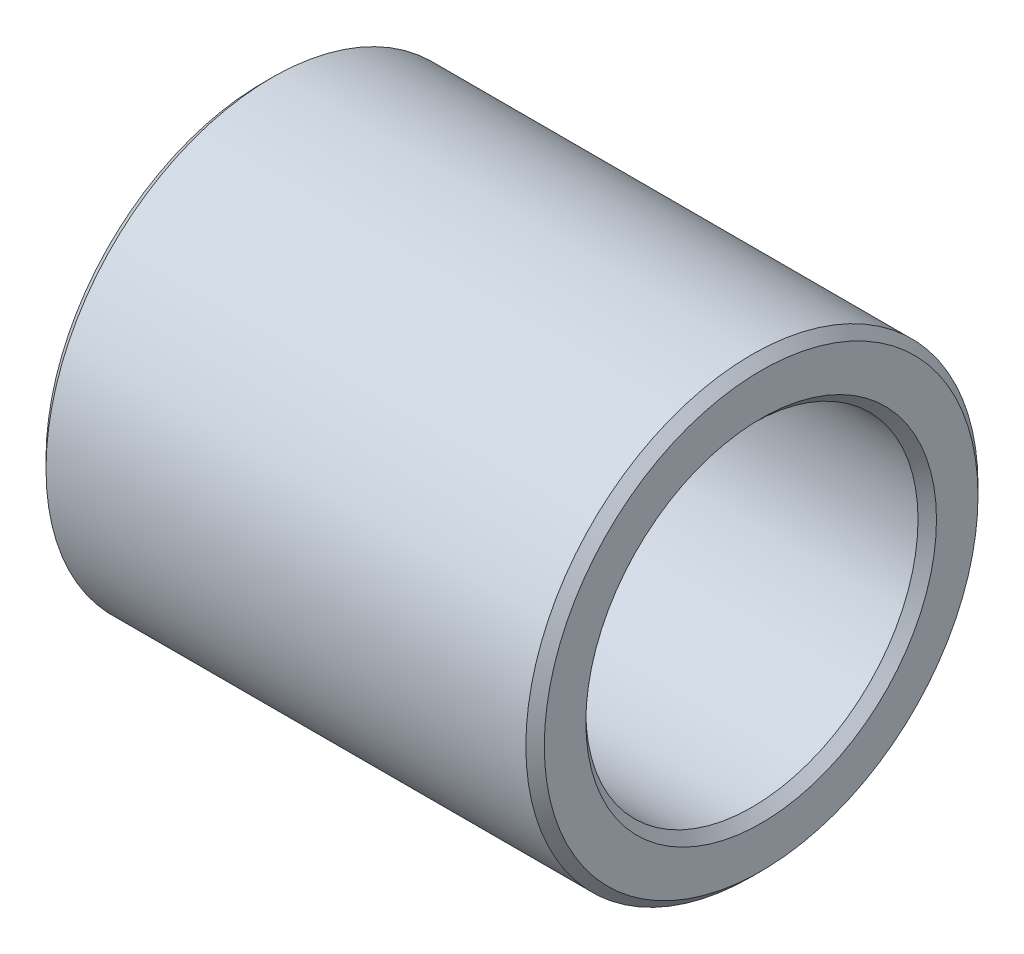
from build123d import *

# Parameters (mm, degrees)
ESQUISSE1_W     = 27
ESQUISSE1_H     = 3.25
CHANFREIN1_SIZE = 0.5


with BuildPart() as part:
    # Esquisse1 → Base-R_vol.-Mince (revolve)
    with BuildSketch(Plane.XY, mode=Mode.PRIVATE) as base_r_vol_mince_sk:
        with Locations((0, 10.625)):
            Rectangle(ESQUISSE1_W, ESQUISSE1_H)
    revolve(base_r_vol_mince_sk.sketch.rotate(Axis((0, 0, 0), (1, 0, 0)), 90), axis=Axis((0, 0, 0), (1, 0, 0)))

    # Chanfrein1
    chanfrein1_edges = [part.edges().sort_by_distance(p)[0] for p in [
        (-13.5, 0, -12.25),
        (13.5, 0, -12.25),
        (13.5, 0, -9),
        (-13.5, 0, -9),
    ]]
    chamfer(chanfrein1_edges, length=CHANFREIN1_SIZE)


solid = part.part
